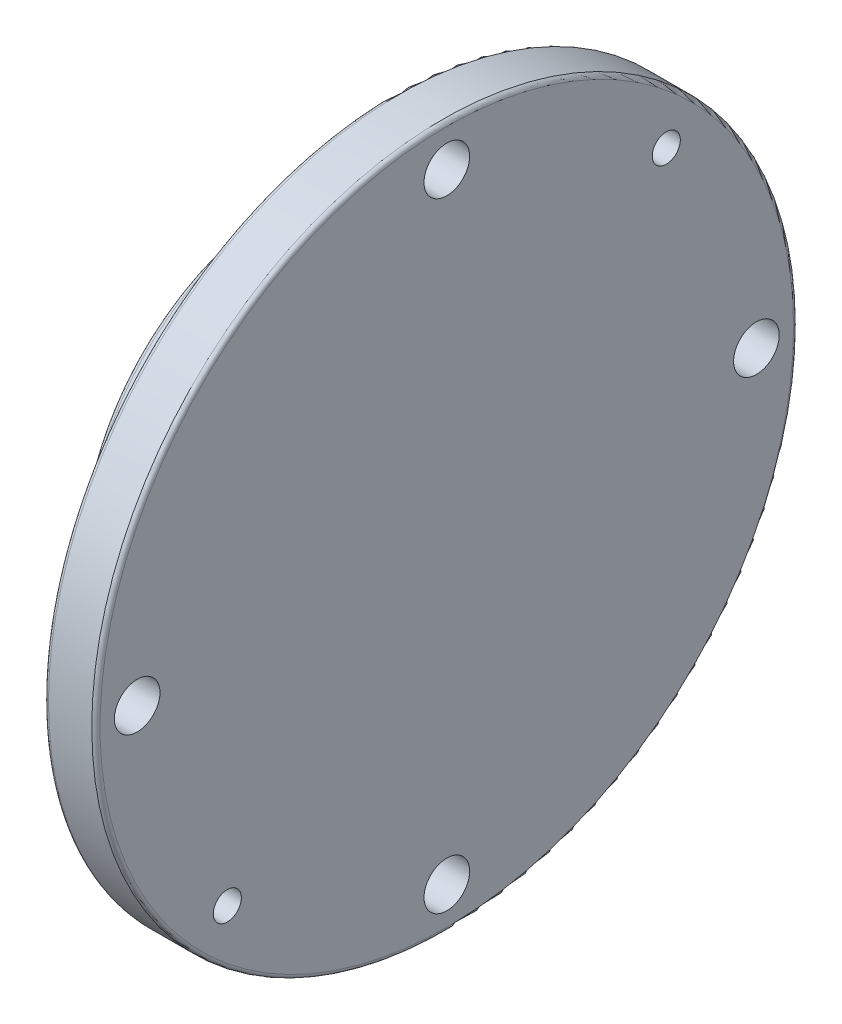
from build123d import *

# Parameters (mm, degrees)
SKETCH2_R             = 2.8067
CUT_EXTRUDE1_DEPTH    = 65.143397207
F_8_32_TAPPED_HOLE1_D = 3.4544
CIRPATTERN1_COUNT     = 2


with BuildPart() as part:
    # Sketch1 → Revolve1 (revolve)
    with BuildSketch(Plane.XY, mode=Mode.PRIVATE) as revolve1_sk:
        with BuildLine():
            Line((-19.630348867, 0), (-19.630348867, 24.8539))
            ThreePointArc((-19.630348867, 24.8539), (-19.481559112, 25.213110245), (-19.122348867, 25.3619))
            Line((-19.122348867, 25.3619), (-15.9258, 25.3619))
            ThreePointArc((-15.9258, 25.3619), (-15.835997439, 25.324702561), (-15.7988, 25.2349))
            Line((-15.7988, 25.2349), (-15.7988, 23.0886))
            ThreePointArc((-15.7988, 23.0886), (-15.650010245, 22.729389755), (-15.2908, 22.5806))
            Line((-15.2908, 22.5806), (-11.43, 22.5806))
            ThreePointArc((-11.43, 22.5806), (-11.070789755, 22.729389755), (-10.922, 23.0886))
            Line((-10.922, 23.0886), (-10.922, 25.2349))
            ThreePointArc((-10.922, 25.2349), (-10.884802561, 25.324702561), (-10.795, 25.3619))
            Line((-10.795, 25.3619), (-7.112, 25.3619))
            ThreePointArc((-7.112, 25.3619), (-6.573184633, 25.585084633), (-6.35, 26.1239))
            Line((-6.35, 26.1239), (-6.35, 28.2448))
            ThreePointArc((-6.35, 28.2448), (-6.312802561, 28.334602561), (-6.223, 28.3718))
            Line((-6.223, 28.3718), (-4.1402, 28.3718))
            ThreePointArc((-4.1402, 28.3718), (-3.780989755, 28.520589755), (-3.6322, 28.8798))
            Line((-3.6322, 28.8798), (-3.6322, 32.6136))
            ThreePointArc((-3.6322, 32.6136), (-3.780989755, 32.972810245), (-4.1402, 33.1216))
            Line((-4.1402, 33.1216), (-6.223, 33.1216))
            ThreePointArc((-6.223, 33.1216), (-6.312802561, 33.158797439), (-6.35, 33.2486))
            Line((-6.35, 33.2486), (-6.35, 42.672))
            ThreePointArc((-6.35, 42.672), (-6.201210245, 43.031210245), (-5.842, 43.18))
            Line((-5.842, 43.18), (-0.508, 43.18))
            ThreePointArc((-0.508, 43.18), (-0.148789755, 43.031210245), (0, 42.672))
            Line((0, 42.672), (0, 0))
            Line((0, 0), (-19.630348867, 0))
        make_face()
    revolve(revolve1_sk.sketch.rotate(Axis((0, 0, 0), (-1, 0, 0)), 90), axis=Axis((0, 0, 0), (-1, 0, 0)))

    # Sketch2 → Cut-Extrude1 (cut, through all)
    with BuildSketch(Plane(origin=(0, 0, 0), x_dir=(0, 0, -1), z_dir=(1, 0, 0))):
        with Locations((0, 38.1)):
            Circle(SKETCH2_R)
        with Locations((38.1, 0)):
            Circle(SKETCH2_R)
        with Locations((0, -38.1)):
            Circle(SKETCH2_R)
        with Locations((-38.1, 0)):
            Circle(SKETCH2_R)
    extrude(amount=-CUT_EXTRUDE1_DEPTH, mode=Mode.SUBTRACT)

    # 8-32 Tapped Hole1 (through all)
    with Locations(Plane(origin=(0, 0, 0), x_dir=(0, 0, -1), z_dir=(1, 0, 0))):
        with Locations((27.008687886, 26.872677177)):
            f_8_32_tapped_hole1 = Hole(F_8_32_TAPPED_HOLE1_D / 2)

    # CirPattern1: 8-32 Tapped Hole1 ×2 about axis
    cirpattern1_axis = Axis((0, 0, 0), (1, 0, 0))
    for i in range(1, CIRPATTERN1_COUNT):
        add(f_8_32_tapped_hole1.rotate(cirpattern1_axis, i * 360 / CIRPATTERN1_COUNT), mode=Mode.SUBTRACT)


solid = part.part
